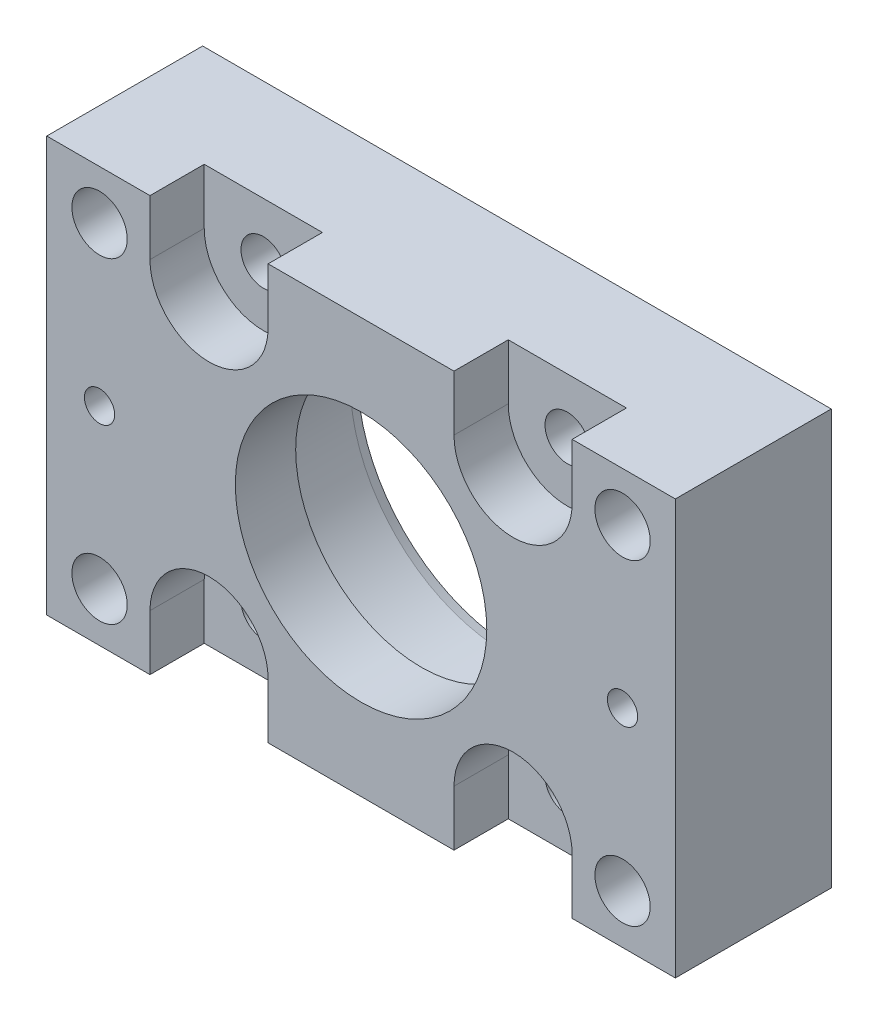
ISO-10303-21;
HEADER;
FILE_DESCRIPTION(('STEP AP214'),'2;1');
FILE_NAME('part.step','',(''),(''),'','','');
FILE_SCHEMA(('AUTOMOTIVE_DESIGN { 1 0 10303 214 1 1 1 1 }'));
ENDSEC;
DATA;
#1=APPLICATION_CONTEXT('core data for automotive mechanical design processes');
#2=APPLICATION_PROTOCOL_DEFINITION('international standard','automotive_design',2000,#1);
#3=PRODUCT_CONTEXT('',#1,'mechanical');
#4=PRODUCT('Part','Part','',(#3));
#5=PRODUCT_RELATED_PRODUCT_CATEGORY('part','',(#4));
#6=PRODUCT_DEFINITION_FORMATION('','',#4);
#7=PRODUCT_DEFINITION_CONTEXT('part definition',#1,'design');
#8=PRODUCT_DEFINITION('design','',#6,#7);
#9=PRODUCT_DEFINITION_SHAPE('','',#8);
#10=(LENGTH_UNIT() NAMED_UNIT(*) SI_UNIT(.MILLI.,.METRE.));
#11=(NAMED_UNIT(*) PLANE_ANGLE_UNIT() SI_UNIT($,.RADIAN.));
#12=(NAMED_UNIT(*) SI_UNIT($,.STERADIAN.) SOLID_ANGLE_UNIT());
#13=UNCERTAINTY_MEASURE_WITH_UNIT(LENGTH_MEASURE(1.E-05),#10,'distance_accuracy_value','');
#14=(GEOMETRIC_REPRESENTATION_CONTEXT(3) GLOBAL_UNCERTAINTY_ASSIGNED_CONTEXT((#13)) GLOBAL_UNIT_ASSIGNED_CONTEXT((#10,
#11,#12)) REPRESENTATION_CONTEXT('',''));
#15=CARTESIAN_POINT('',(0.,0.,0.));
#16=DIRECTION('',(0.,0.,1.));
#17=DIRECTION('',(1.,0.,0.));
#18=AXIS2_PLACEMENT_3D('',#15,#16,#17);
#19=CARTESIAN_POINT('',(60.4576297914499,-60.4576297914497,40.41));
#20=DIRECTION('',(0.,0.,1.));
#21=DIRECTION('',(1.,0.,0.));
#22=AXIS2_PLACEMENT_3D('',#19,#20,#21);
#23=CYLINDRICAL_SURFACE('',#22,23.495);
#24=CARTESIAN_POINT('',(60.4576297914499,-60.4576297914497,62.));
#25=DIRECTION('',(0.,0.,1.));
#26=DIRECTION('',(-1.,0.,0.));
#27=AXIS2_PLACEMENT_3D('',#24,#25,#26);
#28=CIRCLE('',#27,23.495);
#29=CARTESIAN_POINT('',(83.9526297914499,-60.4576297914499,62.));
#30=VERTEX_POINT('',#29);
#31=CARTESIAN_POINT('',(36.9626297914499,-60.4576297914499,62.));
#32=VERTEX_POINT('',#31);
#33=EDGE_CURVE('E305',#30,#32,#28,.T.);
#34=ORIENTED_EDGE('',*,*,#33,.T.);
#35=DIRECTION('',(0.,0.,1.));
#36=VECTOR('',#35,1.);
#37=CARTESIAN_POINT('',(36.9626297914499,-60.4576297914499,-11.4930460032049));
#38=LINE('',#37,#36);
#39=CARTESIAN_POINT('',(36.9626297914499,-60.4576297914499,40.41));
#40=VERTEX_POINT('',#39);
#41=EDGE_CURVE('E160',#40,#32,#38,.T.);
#42=ORIENTED_EDGE('',*,*,#41,.F.);
#43=CARTESIAN_POINT('',(60.4576297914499,-60.4576297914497,40.41));
#44=DIRECTION('',(0.,0.,1.));
#45=DIRECTION('',(-1.,0.,0.));
#46=AXIS2_PLACEMENT_3D('',#43,#44,#45);
#47=CIRCLE('',#46,23.495);
#48=CARTESIAN_POINT('',(83.9526297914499,-60.4576297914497,40.41));
#49=VERTEX_POINT('',#48);
#50=EDGE_CURVE('E228',#49,#40,#47,.T.);
#51=ORIENTED_EDGE('',*,*,#50,.F.);
#52=DIRECTION('',(0.,0.,1.));
#53=VECTOR('',#52,1.);
#54=CARTESIAN_POINT('',(83.9526297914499,-60.4576297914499,-11.4930460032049));
#55=LINE('',#54,#53);
#56=EDGE_CURVE('E576',#49,#30,#55,.T.);
#57=ORIENTED_EDGE('',*,*,#56,.T.);
#58=EDGE_LOOP('',(#34,#42,#51,#57));
#59=FACE_BOUND('',#58,.T.);
#60=ADVANCED_FACE('F14',(#59),#23,.F.);
#61=CARTESIAN_POINT('',(-60.4576297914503,-60.4576297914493,40.41));
#62=DIRECTION('',(0.,0.,1.));
#63=DIRECTION('',(1.,0.,0.));
#64=AXIS2_PLACEMENT_3D('',#61,#62,#63);
#65=CYLINDRICAL_SURFACE('',#64,23.495);
#66=CARTESIAN_POINT('',(-60.4576297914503,-60.4576297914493,62.));
#67=DIRECTION('',(0.,0.,1.));
#68=DIRECTION('',(0.,1.,0.));
#69=AXIS2_PLACEMENT_3D('',#66,#67,#68);
#70=CIRCLE('',#69,23.495);
#71=CARTESIAN_POINT('',(-36.9626297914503,-60.4576297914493,62.));
#72=VERTEX_POINT('',#71);
#73=CARTESIAN_POINT('',(-83.9526297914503,-60.4576297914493,62.));
#74=VERTEX_POINT('',#73);
#75=EDGE_CURVE('E297',#72,#74,#70,.T.);
#76=ORIENTED_EDGE('',*,*,#75,.T.);
#77=DIRECTION('',(0.,0.,1.));
#78=VECTOR('',#77,1.);
#79=CARTESIAN_POINT('',(-83.9526297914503,-60.4576297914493,-11.4930460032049));
#80=LINE('',#79,#78);
#81=CARTESIAN_POINT('',(-83.9526297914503,-60.4576297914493,40.41));
#82=VERTEX_POINT('',#81);
#83=EDGE_CURVE('E362',#82,#74,#80,.T.);
#84=ORIENTED_EDGE('',*,*,#83,.F.);
#85=CARTESIAN_POINT('',(-60.4576297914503,-60.4576297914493,40.41));
#86=DIRECTION('',(0.,0.,1.));
#87=DIRECTION('',(0.,1.,0.));
#88=AXIS2_PLACEMENT_3D('',#85,#86,#87);
#89=CIRCLE('',#88,23.495);
#90=CARTESIAN_POINT('',(-36.9626297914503,-60.4576297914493,40.41));
#91=VERTEX_POINT('',#90);
#92=EDGE_CURVE('E233',#91,#82,#89,.T.);
#93=ORIENTED_EDGE('',*,*,#92,.F.);
#94=DIRECTION('',(0.,0.,1.));
#95=VECTOR('',#94,1.);
#96=CARTESIAN_POINT('',(-36.9626297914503,-60.4576297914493,-11.4930460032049));
#97=LINE('',#96,#95);
#98=EDGE_CURVE('E363',#91,#72,#97,.T.);
#99=ORIENTED_EDGE('',*,*,#98,.T.);
#100=EDGE_LOOP('',(#76,#84,#93,#99));
#101=FACE_BOUND('',#100,.T.);
#102=ADVANCED_FACE('F360',(#101),#65,.F.);
#103=CARTESIAN_POINT('',(-60.4576297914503,-60.4576297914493,0.));
#104=DIRECTION('',(0.,0.,1.));
#105=DIRECTION('',(1.,0.,0.));
#106=AXIS2_PLACEMENT_3D('',#103,#104,#105);
#107=CYLINDRICAL_SURFACE('',#106,8.89);
#108=CARTESIAN_POINT('',(-60.4576297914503,-60.4576297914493,40.41));
#109=DIRECTION('',(0.,0.,1.));
#110=DIRECTION('',(1.,0.,0.));
#111=AXIS2_PLACEMENT_3D('',#108,#109,#110);
#112=CIRCLE('',#111,8.89);
#113=CARTESIAN_POINT('',(-51.5676297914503,-60.4576297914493,40.41));
#114=VERTEX_POINT('',#113);
#115=EDGE_CURVE('E229',#114,#114,#112,.F.);
#116=ORIENTED_EDGE('',*,*,#115,.F.);
#117=EDGE_LOOP('',(#116));
#118=FACE_BOUND('',#117,.T.);
#119=CARTESIAN_POINT('',(-60.4576297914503,-60.4576297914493,19.812));
#120=DIRECTION('',(0.,0.,-1.));
#121=DIRECTION('',(-1.,0.,0.));
#122=AXIS2_PLACEMENT_3D('',#119,#120,#121);
#123=CIRCLE('',#122,8.89);
#124=CARTESIAN_POINT('',(-69.3476297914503,-60.4576297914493,19.812));
#125=VERTEX_POINT('',#124);
#126=EDGE_CURVE('E18',#125,#125,#123,.F.);
#127=ORIENTED_EDGE('',*,*,#126,.F.);
#128=EDGE_LOOP('',(#127));
#129=FACE_BOUND('',#128,.T.);
#130=ADVANCED_FACE('F472',(#118,#129),#107,.F.);
#131=CARTESIAN_POINT('',(60.4576297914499,-60.4576297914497,0.));
#132=DIRECTION('',(0.,0.,1.));
#133=DIRECTION('',(1.,0.,0.));
#134=AXIS2_PLACEMENT_3D('',#131,#132,#133);
#135=CYLINDRICAL_SURFACE('',#134,8.89);
#136=CARTESIAN_POINT('',(60.4576297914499,-60.4576297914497,40.41));
#137=DIRECTION('',(0.,0.,1.));
#138=DIRECTION('',(1.,0.,0.));
#139=AXIS2_PLACEMENT_3D('',#136,#137,#138);
#140=CIRCLE('',#139,8.89);
#141=CARTESIAN_POINT('',(69.3476297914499,-60.4576297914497,40.41));
#142=VERTEX_POINT('',#141);
#143=EDGE_CURVE('E225',#142,#142,#140,.F.);
#144=ORIENTED_EDGE('',*,*,#143,.F.);
#145=EDGE_LOOP('',(#144));
#146=FACE_BOUND('',#145,.T.);
#147=CARTESIAN_POINT('',(60.4576297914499,-60.4576297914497,19.812));
#148=DIRECTION('',(0.,0.,-1.));
#149=DIRECTION('',(-1.,0.,0.));
#150=AXIS2_PLACEMENT_3D('',#147,#148,#149);
#151=CIRCLE('',#150,8.89);
#152=CARTESIAN_POINT('',(51.5676297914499,-60.4576297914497,19.812));
#153=VERTEX_POINT('',#152);
#154=EDGE_CURVE('E245',#153,#153,#151,.F.);
#155=ORIENTED_EDGE('',*,*,#154,.F.);
#156=EDGE_LOOP('',(#155));
#157=FACE_BOUND('',#156,.T.);
#158=ADVANCED_FACE('F488',(#146,#157),#135,.F.);
#159=CARTESIAN_POINT('',(-60.4576297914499,60.4576297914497,0.));
#160=DIRECTION('',(0.,0.,1.));
#161=DIRECTION('',(1.,0.,0.));
#162=AXIS2_PLACEMENT_3D('',#159,#160,#161);
#163=CYLINDRICAL_SURFACE('',#162,8.89);
#164=CARTESIAN_POINT('',(-60.4576297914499,60.4576297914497,40.41));
#165=DIRECTION('',(0.,0.,1.));
#166=DIRECTION('',(1.,0.,0.));
#167=AXIS2_PLACEMENT_3D('',#164,#165,#166);
#168=CIRCLE('',#167,8.89);
#169=CARTESIAN_POINT('',(-51.5676297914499,60.4576297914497,40.41));
#170=VERTEX_POINT('',#169);
#171=EDGE_CURVE('E215',#170,#170,#168,.F.);
#172=ORIENTED_EDGE('',*,*,#171,.F.);
#173=EDGE_LOOP('',(#172));
#174=FACE_BOUND('',#173,.T.);
#175=CARTESIAN_POINT('',(-60.4576297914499,60.4576297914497,19.812));
#176=DIRECTION('',(0.,0.,-1.));
#177=DIRECTION('',(-1.,0.,0.));
#178=AXIS2_PLACEMENT_3D('',#175,#176,#177);
#179=CIRCLE('',#178,8.89);
#180=CARTESIAN_POINT('',(-69.3476297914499,60.4576297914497,19.812));
#181=VERTEX_POINT('',#180);
#182=EDGE_CURVE('E241',#181,#181,#179,.F.);
#183=ORIENTED_EDGE('',*,*,#182,.F.);
#184=EDGE_LOOP('',(#183));
#185=FACE_BOUND('',#184,.T.);
#186=ADVANCED_FACE('F492',(#174,#185),#163,.F.);
#187=CARTESIAN_POINT('',(60.4576297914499,60.4576297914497,0.));
#188=DIRECTION('',(0.,0.,1.));
#189=DIRECTION('',(1.,0.,0.));
#190=AXIS2_PLACEMENT_3D('',#187,#188,#189);
#191=CYLINDRICAL_SURFACE('',#190,8.89);
#192=CARTESIAN_POINT('',(60.4576297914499,60.4576297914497,40.41));
#193=DIRECTION('',(0.,0.,1.));
#194=DIRECTION('',(1.,0.,0.));
#195=AXIS2_PLACEMENT_3D('',#192,#193,#194);
#196=CIRCLE('',#195,8.89);
#197=CARTESIAN_POINT('',(69.3476297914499,60.4576297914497,40.41));
#198=VERTEX_POINT('',#197);
#199=EDGE_CURVE('E220',#198,#198,#196,.F.);
#200=ORIENTED_EDGE('',*,*,#199,.F.);
#201=EDGE_LOOP('',(#200));
#202=FACE_BOUND('',#201,.T.);
#203=CARTESIAN_POINT('',(60.4576297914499,60.4576297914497,19.812));
#204=DIRECTION('',(0.,0.,-1.));
#205=DIRECTION('',(-1.,0.,0.));
#206=AXIS2_PLACEMENT_3D('',#203,#204,#205);
#207=CIRCLE('',#206,8.89);
#208=CARTESIAN_POINT('',(51.5676297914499,60.4576297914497,19.812));
#209=VERTEX_POINT('',#208);
#210=EDGE_CURVE('E236',#209,#209,#207,.F.);
#211=ORIENTED_EDGE('',*,*,#210,.F.);
#212=EDGE_LOOP('',(#211));
#213=FACE_BOUND('',#212,.T.);
#214=ADVANCED_FACE('F494',(#202,#213),#191,.F.);
#215=CARTESIAN_POINT('',(-125.,82.5,62.));
#216=DIRECTION('',(0.,-1.,0.));
#217=DIRECTION('',(1.,0.,0.));
#218=AXIS2_PLACEMENT_3D('',#215,#216,#217);
#219=PLANE('',#218);
#220=DIRECTION('',(-1.,0.,0.));
#221=VECTOR('',#220,1.);
#222=CARTESIAN_POINT('',(-125.,82.5,40.41));
#223=LINE('',#222,#221);
#224=CARTESIAN_POINT('',(83.9526297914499,82.5,40.41));
#225=VERTEX_POINT('',#224);
#226=CARTESIAN_POINT('',(36.9626297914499,82.5,40.41));
#227=VERTEX_POINT('',#226);
#228=EDGE_CURVE('E223',#225,#227,#223,.T.);
#229=ORIENTED_EDGE('',*,*,#228,.F.);
#230=DIRECTION('',(0.,0.,1.));
#231=VECTOR('',#230,1.);
#232=CARTESIAN_POINT('',(83.9526297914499,82.5,-11.4930460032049));
#233=LINE('',#232,#231);
#234=CARTESIAN_POINT('',(83.9526297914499,82.5,62.));
#235=VERTEX_POINT('',#234);
#236=EDGE_CURVE('E565',#225,#235,#233,.T.);
#237=ORIENTED_EDGE('',*,*,#236,.T.);
#238=DIRECTION('',(-1.,0.,0.));
#239=VECTOR('',#238,1.);
#240=CARTESIAN_POINT('',(-125.,82.5,62.));
#241=LINE('',#240,#239);
#242=CARTESIAN_POINT('',(125.,82.5,62.));
#243=VERTEX_POINT('',#242);
#244=EDGE_CURVE('E323',#243,#235,#241,.T.);
#245=ORIENTED_EDGE('',*,*,#244,.F.);
#246=DIRECTION('',(0.,0.,-1.));
#247=VECTOR('',#246,1.);
#248=CARTESIAN_POINT('',(125.,82.5,62.));
#249=LINE('',#248,#247);
#250=CARTESIAN_POINT('',(125.,82.5,0.));
#251=VERTEX_POINT('',#250);
#252=EDGE_CURVE('E192',#243,#251,#249,.T.);
#253=ORIENTED_EDGE('',*,*,#252,.T.);
#254=DIRECTION('',(-1.,0.,0.));
#255=VECTOR('',#254,1.);
#256=CARTESIAN_POINT('',(-125.,82.5,0.));
#257=LINE('',#256,#255);
#258=CARTESIAN_POINT('',(-125.,82.5,0.));
#259=VERTEX_POINT('',#258);
#260=EDGE_CURVE('E193',#251,#259,#257,.T.);
#261=ORIENTED_EDGE('',*,*,#260,.T.);
#262=DIRECTION('',(0.,0.,-1.));
#263=VECTOR('',#262,1.);
#264=CARTESIAN_POINT('',(-125.,82.5,62.));
#265=LINE('',#264,#263);
#266=CARTESIAN_POINT('',(-125.,82.5,62.));
#267=VERTEX_POINT('',#266);
#268=EDGE_CURVE('E212',#267,#259,#265,.T.);
#269=ORIENTED_EDGE('',*,*,#268,.F.);
#270=CARTESIAN_POINT('',(-83.9526297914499,82.5,62.));
#271=VERTEX_POINT('',#270);
#272=EDGE_CURVE('E203',#271,#267,#241,.T.);
#273=ORIENTED_EDGE('',*,*,#272,.F.);
#274=DIRECTION('',(0.,0.,1.));
#275=VECTOR('',#274,1.);
#276=CARTESIAN_POINT('',(-83.9526297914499,82.5,-11.4930460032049));
#277=LINE('',#276,#275);
#278=CARTESIAN_POINT('',(-83.9526297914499,82.5,40.41));
#279=VERTEX_POINT('',#278);
#280=EDGE_CURVE('E378',#279,#271,#277,.T.);
#281=ORIENTED_EDGE('',*,*,#280,.F.);
#282=DIRECTION('',(-1.,0.,0.));
#283=VECTOR('',#282,1.);
#284=CARTESIAN_POINT('',(-125.,82.5,40.41));
#285=LINE('',#284,#283);
#286=CARTESIAN_POINT('',(-36.9626297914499,82.5,40.41));
#287=VERTEX_POINT('',#286);
#288=EDGE_CURVE('E218',#287,#279,#285,.T.);
#289=ORIENTED_EDGE('',*,*,#288,.F.);
#290=DIRECTION('',(0.,0.,1.));
#291=VECTOR('',#290,1.);
#292=CARTESIAN_POINT('',(-36.9626297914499,82.5,-11.4930460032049));
#293=LINE('',#292,#291);
#294=CARTESIAN_POINT('',(-36.9626297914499,82.5,62.));
#295=VERTEX_POINT('',#294);
#296=EDGE_CURVE('E386',#287,#295,#293,.T.);
#297=ORIENTED_EDGE('',*,*,#296,.T.);
#298=CARTESIAN_POINT('',(36.9626297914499,82.5,62.));
#299=VERTEX_POINT('',#298);
#300=EDGE_CURVE('E325',#299,#295,#241,.T.);
#301=ORIENTED_EDGE('',*,*,#300,.F.);
#302=DIRECTION('',(0.,0.,1.));
#303=VECTOR('',#302,1.);
#304=CARTESIAN_POINT('',(36.9626297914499,82.5,-11.4930460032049));
#305=LINE('',#304,#303);
#306=EDGE_CURVE('E568',#227,#299,#305,.T.);
#307=ORIENTED_EDGE('',*,*,#306,.F.);
#308=EDGE_LOOP('',(#229,#237,#245,#253,#261,#269,#273,#281,#289,#297,#301,#307));
#309=FACE_BOUND('',#308,.T.);
#310=ADVANCED_FACE('F341',(#309),#219,.F.);
#311=CARTESIAN_POINT('',(-125.,82.5,62.));
#312=DIRECTION('',(1.,0.,0.));
#313=DIRECTION('',(0.,1.,0.));
#314=AXIS2_PLACEMENT_3D('',#311,#312,#313);
#315=PLANE('',#314);
#316=DIRECTION('',(0.,-1.,0.));
#317=VECTOR('',#316,1.);
#318=CARTESIAN_POINT('',(-125.,82.5,0.));
#319=LINE('',#318,#317);
#320=CARTESIAN_POINT('',(-125.,-82.5,0.));
#321=VERTEX_POINT('',#320);
#322=EDGE_CURVE('E196',#259,#321,#319,.T.);
#323=ORIENTED_EDGE('',*,*,#322,.T.);
#324=DIRECTION('',(0.,0.,-1.));
#325=VECTOR('',#324,1.);
#326=CARTESIAN_POINT('',(-125.,-82.5,62.));
#327=LINE('',#326,#325);
#328=CARTESIAN_POINT('',(-125.,-82.5,62.));
#329=VERTEX_POINT('',#328);
#330=EDGE_CURVE('E209',#329,#321,#327,.T.);
#331=ORIENTED_EDGE('',*,*,#330,.F.);
#332=DIRECTION('',(0.,-1.,0.));
#333=VECTOR('',#332,1.);
#334=CARTESIAN_POINT('',(-125.,82.5,62.));
#335=LINE('',#334,#333);
#336=EDGE_CURVE('E187',#267,#329,#335,.T.);
#337=ORIENTED_EDGE('',*,*,#336,.F.);
#338=ORIENTED_EDGE('',*,*,#268,.T.);
#339=EDGE_LOOP('',(#323,#331,#337,#338));
#340=FACE_BOUND('',#339,.T.);
#341=ADVANCED_FACE('F339',(#340),#315,.F.);
#342=CARTESIAN_POINT('',(-125.,-82.5,62.));
#343=DIRECTION('',(0.,1.,0.));
#344=DIRECTION('',(-1.,0.,0.));
#345=AXIS2_PLACEMENT_3D('',#342,#343,#344);
#346=PLANE('',#345);
#347=DIRECTION('',(1.,0.,0.));
#348=VECTOR('',#347,1.);
#349=CARTESIAN_POINT('',(-125.,-82.5,40.41));
#350=LINE('',#349,#348);
#351=CARTESIAN_POINT('',(-83.9526297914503,-82.5,40.41));
#352=VERTEX_POINT('',#351);
#353=CARTESIAN_POINT('',(-36.9626297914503,-82.5,40.41));
#354=VERTEX_POINT('',#353);
#355=EDGE_CURVE('E232',#352,#354,#350,.T.);
#356=ORIENTED_EDGE('',*,*,#355,.F.);
#357=DIRECTION('',(0.,0.,1.));
#358=VECTOR('',#357,1.);
#359=CARTESIAN_POINT('',(-83.9526297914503,-82.5,-11.4930460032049));
#360=LINE('',#359,#358);
#361=CARTESIAN_POINT('',(-83.9526297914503,-82.5,62.));
#362=VERTEX_POINT('',#361);
#363=EDGE_CURVE('E351',#352,#362,#360,.T.);
#364=ORIENTED_EDGE('',*,*,#363,.T.);
#365=DIRECTION('',(1.,0.,0.));
#366=VECTOR('',#365,1.);
#367=CARTESIAN_POINT('',(-125.,-82.5,62.));
#368=LINE('',#367,#366);
#369=EDGE_CURVE('E182',#329,#362,#368,.T.);
#370=ORIENTED_EDGE('',*,*,#369,.F.);
#371=ORIENTED_EDGE('',*,*,#330,.T.);
#372=DIRECTION('',(1.,0.,0.));
#373=VECTOR('',#372,1.);
#374=CARTESIAN_POINT('',(-125.,-82.5,0.));
#375=LINE('',#374,#373);
#376=CARTESIAN_POINT('',(125.,-82.5,0.));
#377=VERTEX_POINT('',#376);
#378=EDGE_CURVE('E199',#321,#377,#375,.T.);
#379=ORIENTED_EDGE('',*,*,#378,.T.);
#380=DIRECTION('',(0.,0.,-1.));
#381=VECTOR('',#380,1.);
#382=CARTESIAN_POINT('',(125.,-82.5,62.));
#383=LINE('',#382,#381);
#384=CARTESIAN_POINT('',(125.,-82.5,62.));
#385=VERTEX_POINT('',#384);
#386=EDGE_CURVE('E206',#385,#377,#383,.T.);
#387=ORIENTED_EDGE('',*,*,#386,.F.);
#388=CARTESIAN_POINT('',(83.9526297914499,-82.5,62.));
#389=VERTEX_POINT('',#388);
#390=EDGE_CURVE('E183',#389,#385,#368,.T.);
#391=ORIENTED_EDGE('',*,*,#390,.F.);
#392=DIRECTION('',(0.,0.,1.));
#393=VECTOR('',#392,1.);
#394=CARTESIAN_POINT('',(83.9526297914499,-82.5,-11.4930460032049));
#395=LINE('',#394,#393);
#396=CARTESIAN_POINT('',(83.9526297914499,-82.5,40.41));
#397=VERTEX_POINT('',#396);
#398=EDGE_CURVE('E175',#397,#389,#395,.T.);
#399=ORIENTED_EDGE('',*,*,#398,.F.);
#400=DIRECTION('',(1.,0.,0.));
#401=VECTOR('',#400,1.);
#402=CARTESIAN_POINT('',(-125.,-82.5,40.41));
#403=LINE('',#402,#401);
#404=CARTESIAN_POINT('',(36.9626297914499,-82.5,40.41));
#405=VERTEX_POINT('',#404);
#406=EDGE_CURVE('E173',#405,#397,#403,.T.);
#407=ORIENTED_EDGE('',*,*,#406,.F.);
#408=DIRECTION('',(0.,0.,1.));
#409=VECTOR('',#408,1.);
#410=CARTESIAN_POINT('',(36.9626297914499,-82.5,-11.4930460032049));
#411=LINE('',#410,#409);
#412=CARTESIAN_POINT('',(36.9626297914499,-82.5,62.));
#413=VERTEX_POINT('',#412);
#414=EDGE_CURVE('E158',#405,#413,#411,.T.);
#415=ORIENTED_EDGE('',*,*,#414,.T.);
#416=CARTESIAN_POINT('',(-36.9626297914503,-82.5,62.));
#417=VERTEX_POINT('',#416);
#418=EDGE_CURVE('E171',#417,#413,#368,.T.);
#419=ORIENTED_EDGE('',*,*,#418,.F.);
#420=DIRECTION('',(0.,0.,1.));
#421=VECTOR('',#420,1.);
#422=CARTESIAN_POINT('',(-36.9626297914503,-82.5,-11.4930460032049));
#423=LINE('',#422,#421);
#424=EDGE_CURVE('E367',#354,#417,#423,.T.);
#425=ORIENTED_EDGE('',*,*,#424,.F.);
#426=EDGE_LOOP('',(#356,#364,#370,#371,#379,#387,#391,#399,#407,#415,#419,#425));
#427=FACE_BOUND('',#426,.T.);
#428=ADVANCED_FACE('F169',(#427),#346,.F.);
#429=CARTESIAN_POINT('',(125.,82.5,62.));
#430=DIRECTION('',(-1.,0.,0.));
#431=DIRECTION('',(0.,-1.,0.));
#432=AXIS2_PLACEMENT_3D('',#429,#430,#431);
#433=PLANE('',#432);
#434=DIRECTION('',(0.,1.,0.));
#435=VECTOR('',#434,1.);
#436=CARTESIAN_POINT('',(125.,82.5,0.));
#437=LINE('',#436,#435);
#438=EDGE_CURVE('E201',#377,#251,#437,.T.);
#439=ORIENTED_EDGE('',*,*,#438,.T.);
#440=ORIENTED_EDGE('',*,*,#252,.F.);
#441=DIRECTION('',(0.,1.,0.));
#442=VECTOR('',#441,1.);
#443=CARTESIAN_POINT('',(125.,82.5,62.));
#444=LINE('',#443,#442);
#445=EDGE_CURVE('E186',#385,#243,#444,.T.);
#446=ORIENTED_EDGE('',*,*,#445,.F.);
#447=ORIENTED_EDGE('',*,*,#386,.T.);
#448=EDGE_LOOP('',(#439,#440,#446,#447));
#449=FACE_BOUND('',#448,.T.);
#450=ADVANCED_FACE('F442',(#449),#433,.F.);
#451=CARTESIAN_POINT('',(0.,0.,62.));
#452=DIRECTION('',(0.,0.,-1.));
#453=DIRECTION('',(-1.,0.,0.));
#454=AXIS2_PLACEMENT_3D('',#451,#452,#453);
#455=PLANE('',#454);
#456=CARTESIAN_POINT('',(104.,0.,62.));
#457=DIRECTION('',(0.,0.,1.));
#458=DIRECTION('',(1.,0.,0.));
#459=AXIS2_PLACEMENT_3D('',#456,#457,#458);
#460=CIRCLE('',#459,6.00634993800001);
#461=CARTESIAN_POINT('',(110.006349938,0.,62.));
#462=VERTEX_POINT('',#461);
#463=EDGE_CURVE('E380',#462,#462,#460,.T.);
#464=ORIENTED_EDGE('',*,*,#463,.F.);
#465=EDGE_LOOP('',(#464));
#466=FACE_BOUND('',#465,.T.);
#467=CARTESIAN_POINT('',(-104.,0.,62.));
#468=DIRECTION('',(0.,0.,1.));
#469=DIRECTION('',(1.,0.,0.));
#470=AXIS2_PLACEMENT_3D('',#467,#468,#469);
#471=CIRCLE('',#470,6.00634993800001);
#472=CARTESIAN_POINT('',(-97.993650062,0.,62.));
#473=VERTEX_POINT('',#472);
#474=EDGE_CURVE('E395',#473,#473,#471,.T.);
#475=ORIENTED_EDGE('',*,*,#474,.F.);
#476=EDGE_LOOP('',(#475));
#477=FACE_BOUND('',#476,.T.);
#478=CARTESIAN_POINT('',(104.,-63.,62.));
#479=DIRECTION('',(0.,0.,1.));
#480=DIRECTION('',(1.,0.,0.));
#481=AXIS2_PLACEMENT_3D('',#478,#479,#480);
#482=CIRCLE('',#481,11.);
#483=CARTESIAN_POINT('',(115.,-63.,62.));
#484=VERTEX_POINT('',#483);
#485=EDGE_CURVE('E239',#484,#484,#482,.T.);
#486=ORIENTED_EDGE('',*,*,#485,.F.);
#487=EDGE_LOOP('',(#486));
#488=FACE_BOUND('',#487,.T.);
#489=CARTESIAN_POINT('',(-104.,-63.,62.));
#490=DIRECTION('',(0.,0.,1.));
#491=DIRECTION('',(-1.,0.,0.));
#492=AXIS2_PLACEMENT_3D('',#489,#490,#491);
#493=CIRCLE('',#492,11.);
#494=CARTESIAN_POINT('',(-115.,-63.,62.));
#495=VERTEX_POINT('',#494);
#496=EDGE_CURVE('E273',#495,#495,#493,.T.);
#497=ORIENTED_EDGE('',*,*,#496,.F.);
#498=EDGE_LOOP('',(#497));
#499=FACE_BOUND('',#498,.T.);
#500=CARTESIAN_POINT('',(104.,63.,62.));
#501=DIRECTION('',(0.,0.,1.));
#502=DIRECTION('',(-1.,0.,0.));
#503=AXIS2_PLACEMENT_3D('',#500,#501,#502);
#504=CIRCLE('',#503,11.);
#505=CARTESIAN_POINT('',(93.,63.,62.));
#506=VERTEX_POINT('',#505);
#507=EDGE_CURVE('E279',#506,#506,#504,.T.);
#508=ORIENTED_EDGE('',*,*,#507,.F.);
#509=EDGE_LOOP('',(#508));
#510=FACE_BOUND('',#509,.T.);
#511=CARTESIAN_POINT('',(-104.,63.,62.));
#512=DIRECTION('',(0.,0.,1.));
#513=DIRECTION('',(1.,0.,0.));
#514=AXIS2_PLACEMENT_3D('',#511,#512,#513);
#515=CIRCLE('',#514,11.);
#516=CARTESIAN_POINT('',(-93.,63.,62.));
#517=VERTEX_POINT('',#516);
#518=EDGE_CURVE('E285',#517,#517,#515,.T.);
#519=ORIENTED_EDGE('',*,*,#518,.F.);
#520=EDGE_LOOP('',(#519));
#521=FACE_BOUND('',#520,.T.);
#522=CARTESIAN_POINT('',(0.,0.,62.));
#523=DIRECTION('',(0.,0.,-1.));
#524=DIRECTION('',(-1.,0.,0.));
#525=AXIS2_PLACEMENT_3D('',#522,#523,#524);
#526=CIRCLE('',#525,50.);
#527=CARTESIAN_POINT('',(-50.,0.,62.));
#528=VERTEX_POINT('',#527);
#529=EDGE_CURVE('E294',#528,#528,#526,.T.);
#530=ORIENTED_EDGE('',*,*,#529,.T.);
#531=EDGE_LOOP('',(#530));
#532=FACE_BOUND('',#531,.T.);
#533=CARTESIAN_POINT('',(60.4576297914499,60.4576297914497,62.));
#534=DIRECTION('',(0.,0.,1.));
#535=DIRECTION('',(0.,-1.,0.));
#536=AXIS2_PLACEMENT_3D('',#533,#534,#535);
#537=CIRCLE('',#536,23.495);
#538=CARTESIAN_POINT('',(36.9626297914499,60.4576297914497,62.));
#539=VERTEX_POINT('',#538);
#540=CARTESIAN_POINT('',(83.9526297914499,60.4576297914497,62.));
#541=VERTEX_POINT('',#540);
#542=EDGE_CURVE('E310',#539,#541,#537,.T.);
#543=ORIENTED_EDGE('',*,*,#542,.F.);
#544=DIRECTION('',(0.,-1.,0.));
#545=VECTOR('',#544,1.);
#546=CARTESIAN_POINT('',(36.9626297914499,60.4576297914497,62.));
#547=LINE('',#546,#545);
#548=EDGE_CURVE('E558',#299,#539,#547,.T.);
#549=ORIENTED_EDGE('',*,*,#548,.F.);
#550=ORIENTED_EDGE('',*,*,#300,.T.);
#551=DIRECTION('',(0.,1.,0.));
#552=VECTOR('',#551,1.);
#553=CARTESIAN_POINT('',(-36.9626297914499,60.4576297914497,62.));
#554=LINE('',#553,#552);
#555=CARTESIAN_POINT('',(-36.9626297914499,60.4576297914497,62.));
#556=VERTEX_POINT('',#555);
#557=EDGE_CURVE('E382',#556,#295,#554,.T.);
#558=ORIENTED_EDGE('',*,*,#557,.F.);
#559=CARTESIAN_POINT('',(-60.4576297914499,60.4576297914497,62.));
#560=DIRECTION('',(0.,0.,1.));
#561=DIRECTION('',(1.,0.,0.));
#562=AXIS2_PLACEMENT_3D('',#559,#560,#561);
#563=CIRCLE('',#562,23.495);
#564=CARTESIAN_POINT('',(-83.9526297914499,60.4576297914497,62.));
#565=VERTEX_POINT('',#564);
#566=EDGE_CURVE('E316',#565,#556,#563,.T.);
#567=ORIENTED_EDGE('',*,*,#566,.F.);
#568=DIRECTION('',(0.,-1.,0.));
#569=VECTOR('',#568,1.);
#570=CARTESIAN_POINT('',(-83.9526297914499,60.4576297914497,62.));
#571=LINE('',#570,#569);
#572=EDGE_CURVE('E334',#271,#565,#571,.T.);
#573=ORIENTED_EDGE('',*,*,#572,.F.);
#574=ORIENTED_EDGE('',*,*,#272,.T.);
#575=ORIENTED_EDGE('',*,*,#336,.T.);
#576=ORIENTED_EDGE('',*,*,#369,.T.);
#577=DIRECTION('',(0.,-1.,0.));
#578=VECTOR('',#577,1.);
#579=CARTESIAN_POINT('',(-83.9526297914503,-60.4576297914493,62.));
#580=LINE('',#579,#578);
#581=EDGE_CURVE('E353',#74,#362,#580,.T.);
#582=ORIENTED_EDGE('',*,*,#581,.F.);
#583=ORIENTED_EDGE('',*,*,#75,.F.);
#584=DIRECTION('',(0.,1.,0.));
#585=VECTOR('',#584,1.);
#586=CARTESIAN_POINT('',(-36.9626297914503,-60.4576297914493,62.));
#587=LINE('',#586,#585);
#588=EDGE_CURVE('E181',#417,#72,#587,.T.);
#589=ORIENTED_EDGE('',*,*,#588,.F.);
#590=ORIENTED_EDGE('',*,*,#418,.T.);
#591=DIRECTION('',(0.,-1.,0.));
#592=VECTOR('',#591,1.);
#593=CARTESIAN_POINT('',(36.9626297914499,-60.4576297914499,62.));
#594=LINE('',#593,#592);
#595=EDGE_CURVE('E155',#32,#413,#594,.T.);
#596=ORIENTED_EDGE('',*,*,#595,.F.);
#597=ORIENTED_EDGE('',*,*,#33,.F.);
#598=DIRECTION('',(0.,1.,0.));
#599=VECTOR('',#598,1.);
#600=CARTESIAN_POINT('',(83.9526297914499,-60.4576297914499,62.));
#601=LINE('',#600,#599);
#602=EDGE_CURVE('E165',#389,#30,#601,.T.);
#603=ORIENTED_EDGE('',*,*,#602,.F.);
#604=ORIENTED_EDGE('',*,*,#390,.T.);
#605=ORIENTED_EDGE('',*,*,#445,.T.);
#606=ORIENTED_EDGE('',*,*,#244,.T.);
#607=DIRECTION('',(0.,1.,0.));
#608=VECTOR('',#607,1.);
#609=CARTESIAN_POINT('',(83.9526297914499,60.4576297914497,62.));
#610=LINE('',#609,#608);
#611=EDGE_CURVE('E563',#541,#235,#610,.T.);
#612=ORIENTED_EDGE('',*,*,#611,.F.);
#613=EDGE_LOOP('',(#543,#549,#550,#558,#567,#573,#574,#575,#576,#582,#583,#589,#590,#596,#597,
#603,#604,#605,#606,#612));
#614=FACE_BOUND('',#613,.T.);
#615=ADVANCED_FACE('F179',(#466,#477,#488,#499,#510,#521,#532,#614),#455,.F.);
#616=CARTESIAN_POINT('',(0.,0.,0.));
#617=DIRECTION('',(0.,0.,-1.));
#618=DIRECTION('',(-1.,0.,0.));
#619=AXIS2_PLACEMENT_3D('',#616,#617,#618);
#620=PLANE('',#619);
#621=CARTESIAN_POINT('',(-60.4576297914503,-60.4576297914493,0.));
#622=DIRECTION('',(0.,0.,-1.));
#623=DIRECTION('',(-1.,0.,0.));
#624=AXIS2_PLACEMENT_3D('',#621,#622,#623);
#625=CIRCLE('',#624,19.05);
#626=CARTESIAN_POINT('',(-79.5076297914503,-60.4576297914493,0.));
#627=VERTEX_POINT('',#626);
#628=EDGE_CURVE('E261',#627,#627,#625,.T.);
#629=ORIENTED_EDGE('',*,*,#628,.F.);
#630=EDGE_LOOP('',(#629));
#631=FACE_BOUND('',#630,.T.);
#632=CARTESIAN_POINT('',(60.4576297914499,-60.4576297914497,0.));
#633=DIRECTION('',(0.,0.,-1.));
#634=DIRECTION('',(-1.,0.,0.));
#635=AXIS2_PLACEMENT_3D('',#632,#633,#634);
#636=CIRCLE('',#635,19.05);
#637=CARTESIAN_POINT('',(41.4076297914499,-60.4576297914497,0.));
#638=VERTEX_POINT('',#637);
#639=EDGE_CURVE('E254',#638,#638,#636,.T.);
#640=ORIENTED_EDGE('',*,*,#639,.F.);
#641=EDGE_LOOP('',(#640));
#642=FACE_BOUND('',#641,.T.);
#643=CARTESIAN_POINT('',(-60.4576297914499,60.4576297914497,0.));
#644=DIRECTION('',(0.,0.,-1.));
#645=DIRECTION('',(-1.,0.,0.));
#646=AXIS2_PLACEMENT_3D('',#643,#644,#645);
#647=CIRCLE('',#646,19.05);
#648=CARTESIAN_POINT('',(-79.5076297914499,60.4576297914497,0.));
#649=VERTEX_POINT('',#648);
#650=EDGE_CURVE('E247',#649,#649,#647,.T.);
#651=ORIENTED_EDGE('',*,*,#650,.F.);
#652=EDGE_LOOP('',(#651));
#653=FACE_BOUND('',#652,.T.);
#654=CARTESIAN_POINT('',(60.4576297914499,60.4576297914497,0.));
#655=DIRECTION('',(0.,0.,-1.));
#656=DIRECTION('',(-1.,0.,0.));
#657=AXIS2_PLACEMENT_3D('',#654,#655,#656);
#658=CIRCLE('',#657,19.05);
#659=CARTESIAN_POINT('',(41.4076297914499,60.4576297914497,0.));
#660=VERTEX_POINT('',#659);
#661=EDGE_CURVE('E243',#660,#660,#658,.T.);
#662=ORIENTED_EDGE('',*,*,#661,.F.);
#663=EDGE_LOOP('',(#662));
#664=FACE_BOUND('',#663,.T.);
#665=CARTESIAN_POINT('',(0.,0.,0.));
#666=DIRECTION('',(0.,0.,-1.));
#667=DIRECTION('',(-1.,0.,0.));
#668=AXIS2_PLACEMENT_3D('',#665,#666,#667);
#669=CIRCLE('',#668,63.3923077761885);
#670=CARTESIAN_POINT('',(-63.3923077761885,0.,0.));
#671=VERTEX_POINT('',#670);
#672=EDGE_CURVE('E23',#671,#671,#669,.F.);
#673=ORIENTED_EDGE('',*,*,#672,.T.);
#674=EDGE_LOOP('',(#673));
#675=FACE_BOUND('',#674,.T.);
#676=CARTESIAN_POINT('',(104.,-63.,0.));
#677=DIRECTION('',(0.,0.,1.));
#678=DIRECTION('',(1.,0.,0.));
#679=AXIS2_PLACEMENT_3D('',#676,#677,#678);
#680=CIRCLE('',#679,11.);
#681=CARTESIAN_POINT('',(115.,-63.,0.));
#682=VERTEX_POINT('',#681);
#683=EDGE_CURVE('E270',#682,#682,#680,.T.);
#684=ORIENTED_EDGE('',*,*,#683,.T.);
#685=EDGE_LOOP('',(#684));
#686=FACE_BOUND('',#685,.T.);
#687=CARTESIAN_POINT('',(-104.,-63.,0.));
#688=DIRECTION('',(0.,0.,1.));
#689=DIRECTION('',(-1.,0.,0.));
#690=AXIS2_PLACEMENT_3D('',#687,#688,#689);
#691=CIRCLE('',#690,11.);
#692=CARTESIAN_POINT('',(-115.,-63.,0.));
#693=VERTEX_POINT('',#692);
#694=EDGE_CURVE('E276',#693,#693,#691,.T.);
#695=ORIENTED_EDGE('',*,*,#694,.T.);
#696=EDGE_LOOP('',(#695));
#697=FACE_BOUND('',#696,.T.);
#698=CARTESIAN_POINT('',(104.,63.,0.));
#699=DIRECTION('',(0.,0.,1.));
#700=DIRECTION('',(-1.,0.,0.));
#701=AXIS2_PLACEMENT_3D('',#698,#699,#700);
#702=CIRCLE('',#701,11.);
#703=CARTESIAN_POINT('',(93.,63.,0.));
#704=VERTEX_POINT('',#703);
#705=EDGE_CURVE('E282',#704,#704,#702,.T.);
#706=ORIENTED_EDGE('',*,*,#705,.T.);
#707=EDGE_LOOP('',(#706));
#708=FACE_BOUND('',#707,.T.);
#709=CARTESIAN_POINT('',(-104.,63.,0.));
#710=DIRECTION('',(0.,0.,1.));
#711=DIRECTION('',(1.,0.,0.));
#712=AXIS2_PLACEMENT_3D('',#709,#710,#711);
#713=CIRCLE('',#712,11.);
#714=CARTESIAN_POINT('',(-93.,63.,0.));
#715=VERTEX_POINT('',#714);
#716=EDGE_CURVE('E288',#715,#715,#713,.T.);
#717=ORIENTED_EDGE('',*,*,#716,.T.);
#718=EDGE_LOOP('',(#717));
#719=FACE_BOUND('',#718,.T.);
#720=ORIENTED_EDGE('',*,*,#260,.F.);
#721=ORIENTED_EDGE('',*,*,#438,.F.);
#722=ORIENTED_EDGE('',*,*,#378,.F.);
#723=ORIENTED_EDGE('',*,*,#322,.F.);
#724=EDGE_LOOP('',(#720,#721,#722,#723));
#725=FACE_BOUND('',#724,.T.);
#726=ADVANCED_FACE('F346',(#631,#642,#653,#664,#675,#686,#697,#708,#719,#725),#620,.T.);
#727=CARTESIAN_POINT('',(0.,0.,38.));
#728=DIRECTION('',(0.,0.,-1.));
#729=DIRECTION('',(-1.,0.,0.));
#730=AXIS2_PLACEMENT_3D('',#727,#728,#729);
#731=CYLINDRICAL_SURFACE('',#730,62.512699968);
#732=CARTESIAN_POINT('',(0.,0.,3.81000000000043));
#733=DIRECTION('',(0.,0.,-1.));
#734=DIRECTION('',(-1.,0.,0.));
#735=AXIS2_PLACEMENT_3D('',#732,#733,#734);
#736=CIRCLE('',#735,62.512699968);
#737=CARTESIAN_POINT('',(-62.512699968,0.,3.81000000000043));
#738=VERTEX_POINT('',#737);
#739=EDGE_CURVE('E9',#738,#738,#736,.T.);
#740=ORIENTED_EDGE('',*,*,#739,.T.);
#741=EDGE_LOOP('',(#740));
#742=FACE_BOUND('',#741,.T.);
#743=CARTESIAN_POINT('',(0.,0.,38.));
#744=DIRECTION('',(0.,0.,1.));
#745=DIRECTION('',(1.,0.,0.));
#746=AXIS2_PLACEMENT_3D('',#743,#744,#745);
#747=CIRCLE('',#746,62.512699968);
#748=CARTESIAN_POINT('',(62.512699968,0.,38.));
#749=VERTEX_POINT('',#748);
#750=EDGE_CURVE('E197',#749,#749,#747,.T.);
#751=ORIENTED_EDGE('',*,*,#750,.T.);
#752=EDGE_LOOP('',(#751));
#753=FACE_BOUND('',#752,.T.);
#754=ADVANCED_FACE('F414',(#742,#753),#731,.F.);
#755=CARTESIAN_POINT('',(0.,0.,38.));
#756=DIRECTION('',(0.,0.,1.));
#757=DIRECTION('',(1.,0.,0.));
#758=AXIS2_PLACEMENT_3D('',#755,#756,#757);
#759=PLANE('',#758);
#760=CARTESIAN_POINT('',(0.,0.,38.));
#761=DIRECTION('',(0.,0.,-1.));
#762=DIRECTION('',(-1.,0.,0.));
#763=AXIS2_PLACEMENT_3D('',#760,#761,#762);
#764=CIRCLE('',#763,50.);
#765=CARTESIAN_POINT('',(-50.,0.,38.));
#766=VERTEX_POINT('',#765);
#767=EDGE_CURVE('E291',#766,#766,#764,.T.);
#768=ORIENTED_EDGE('',*,*,#767,.F.);
#769=EDGE_LOOP('',(#768));
#770=FACE_BOUND('',#769,.T.);
#771=ORIENTED_EDGE('',*,*,#750,.F.);
#772=EDGE_LOOP('',(#771));
#773=FACE_BOUND('',#772,.T.);
#774=ADVANCED_FACE('F453',(#770,#773),#759,.F.);
#775=CARTESIAN_POINT('',(-60.4576297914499,60.4576297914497,40.41));
#776=DIRECTION('',(0.,0.,1.));
#777=DIRECTION('',(1.,0.,0.));
#778=AXIS2_PLACEMENT_3D('',#775,#776,#777);
#779=CYLINDRICAL_SURFACE('',#778,23.495);
#780=ORIENTED_EDGE('',*,*,#566,.T.);
#781=DIRECTION('',(0.,0.,1.));
#782=VECTOR('',#781,1.);
#783=CARTESIAN_POINT('',(-36.9626297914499,60.4576297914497,-11.4930460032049));
#784=LINE('',#783,#782);
#785=CARTESIAN_POINT('',(-36.9626297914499,60.4576297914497,40.41));
#786=VERTEX_POINT('',#785);
#787=EDGE_CURVE('E389',#786,#556,#784,.T.);
#788=ORIENTED_EDGE('',*,*,#787,.F.);
#789=CARTESIAN_POINT('',(-60.4576297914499,60.4576297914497,40.41));
#790=DIRECTION('',(0.,0.,1.));
#791=DIRECTION('',(1.,0.,0.));
#792=AXIS2_PLACEMENT_3D('',#789,#790,#791);
#793=CIRCLE('',#792,23.495);
#794=CARTESIAN_POINT('',(-83.9526297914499,60.4576297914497,40.41));
#795=VERTEX_POINT('',#794);
#796=EDGE_CURVE('E219',#795,#786,#793,.T.);
#797=ORIENTED_EDGE('',*,*,#796,.F.);
#798=DIRECTION('',(0.,0.,1.));
#799=VECTOR('',#798,1.);
#800=CARTESIAN_POINT('',(-83.9526297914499,60.4576297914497,-11.4930460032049));
#801=LINE('',#800,#799);
#802=EDGE_CURVE('E31',#795,#565,#801,.T.);
#803=ORIENTED_EDGE('',*,*,#802,.T.);
#804=EDGE_LOOP('',(#780,#788,#797,#803));
#805=FACE_BOUND('',#804,.T.);
#806=ADVANCED_FACE('F456',(#805),#779,.F.);
#807=CARTESIAN_POINT('',(-60.4576297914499,60.4576297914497,40.41));
#808=DIRECTION('',(0.,0.,1.));
#809=DIRECTION('',(1.,0.,0.));
#810=AXIS2_PLACEMENT_3D('',#807,#808,#809);
#811=PLANE('',#810);
#812=ORIENTED_EDGE('',*,*,#171,.T.);
#813=EDGE_LOOP('',(#812));
#814=FACE_BOUND('',#813,.T.);
#815=ORIENTED_EDGE('',*,*,#288,.T.);
#816=DIRECTION('',(0.,1.,0.));
#817=VECTOR('',#816,1.);
#818=CARTESIAN_POINT('',(-83.9526297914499,60.4576297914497,40.41));
#819=LINE('',#818,#817);
#820=EDGE_CURVE('E377',#795,#279,#819,.T.);
#821=ORIENTED_EDGE('',*,*,#820,.F.);
#822=ORIENTED_EDGE('',*,*,#796,.T.);
#823=DIRECTION('',(0.,-1.,0.));
#824=VECTOR('',#823,1.);
#825=CARTESIAN_POINT('',(-36.9626297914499,60.4576297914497,40.41));
#826=LINE('',#825,#824);
#827=EDGE_CURVE('E375',#287,#786,#826,.T.);
#828=ORIENTED_EDGE('',*,*,#827,.F.);
#829=EDGE_LOOP('',(#815,#821,#822,#828));
#830=FACE_BOUND('',#829,.T.);
#831=ADVANCED_FACE('F484',(#814,#830),#811,.T.);
#832=CARTESIAN_POINT('',(60.4576297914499,60.4576297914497,40.41));
#833=DIRECTION('',(0.,0.,1.));
#834=DIRECTION('',(1.,0.,0.));
#835=AXIS2_PLACEMENT_3D('',#832,#833,#834);
#836=CYLINDRICAL_SURFACE('',#835,23.495);
#837=ORIENTED_EDGE('',*,*,#542,.T.);
#838=DIRECTION('',(0.,0.,1.));
#839=VECTOR('',#838,1.);
#840=CARTESIAN_POINT('',(83.9526297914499,60.4576297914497,-11.4930460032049));
#841=LINE('',#840,#839);
#842=CARTESIAN_POINT('',(83.9526297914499,60.4576297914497,40.41));
#843=VERTEX_POINT('',#842);
#844=EDGE_CURVE('E562',#843,#541,#841,.T.);
#845=ORIENTED_EDGE('',*,*,#844,.F.);
#846=CARTESIAN_POINT('',(60.4576297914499,60.4576297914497,40.41));
#847=DIRECTION('',(0.,0.,1.));
#848=DIRECTION('',(0.,-1.,0.));
#849=AXIS2_PLACEMENT_3D('',#846,#847,#848);
#850=CIRCLE('',#849,23.495);
#851=CARTESIAN_POINT('',(36.9626297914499,60.4576297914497,40.41));
#852=VERTEX_POINT('',#851);
#853=EDGE_CURVE('E224',#852,#843,#850,.T.);
#854=ORIENTED_EDGE('',*,*,#853,.F.);
#855=DIRECTION('',(0.,0.,1.));
#856=VECTOR('',#855,1.);
#857=CARTESIAN_POINT('',(36.9626297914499,60.4576297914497,-11.4930460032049));
#858=LINE('',#857,#856);
#859=EDGE_CURVE('E39',#852,#539,#858,.T.);
#860=ORIENTED_EDGE('',*,*,#859,.T.);
#861=EDGE_LOOP('',(#837,#845,#854,#860));
#862=FACE_BOUND('',#861,.T.);
#863=ADVANCED_FACE('F480',(#862),#836,.F.);
#864=CARTESIAN_POINT('',(60.4576297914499,60.4576297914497,40.41));
#865=DIRECTION('',(0.,0.,1.));
#866=DIRECTION('',(0.,-1.,0.));
#867=AXIS2_PLACEMENT_3D('',#864,#865,#866);
#868=PLANE('',#867);
#869=ORIENTED_EDGE('',*,*,#199,.T.);
#870=EDGE_LOOP('',(#869));
#871=FACE_BOUND('',#870,.T.);
#872=ORIENTED_EDGE('',*,*,#228,.T.);
#873=DIRECTION('',(0.,1.,0.));
#874=VECTOR('',#873,1.);
#875=CARTESIAN_POINT('',(36.9626297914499,60.4576297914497,40.41));
#876=LINE('',#875,#874);
#877=EDGE_CURVE('E383',#852,#227,#876,.T.);
#878=ORIENTED_EDGE('',*,*,#877,.F.);
#879=ORIENTED_EDGE('',*,*,#853,.T.);
#880=DIRECTION('',(0.,-1.,0.));
#881=VECTOR('',#880,1.);
#882=CARTESIAN_POINT('',(83.9526297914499,60.4576297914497,40.41));
#883=LINE('',#882,#881);
#884=EDGE_CURVE('E570',#225,#843,#883,.T.);
#885=ORIENTED_EDGE('',*,*,#884,.F.);
#886=EDGE_LOOP('',(#872,#878,#879,#885));
#887=FACE_BOUND('',#886,.T.);
#888=ADVANCED_FACE('F477',(#871,#887),#868,.T.);
#889=CARTESIAN_POINT('',(60.4576297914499,-60.4576297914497,40.41));
#890=DIRECTION('',(0.,0.,1.));
#891=DIRECTION('',(-1.,0.,0.));
#892=AXIS2_PLACEMENT_3D('',#889,#890,#891);
#893=PLANE('',#892);
#894=ORIENTED_EDGE('',*,*,#143,.T.);
#895=EDGE_LOOP('',(#894));
#896=FACE_BOUND('',#895,.T.);
#897=ORIENTED_EDGE('',*,*,#406,.T.);
#898=DIRECTION('',(0.,-1.,0.));
#899=VECTOR('',#898,1.);
#900=CARTESIAN_POINT('',(83.9526297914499,-60.4576297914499,40.41));
#901=LINE('',#900,#899);
#902=EDGE_CURVE('E580',#49,#397,#901,.T.);
#903=ORIENTED_EDGE('',*,*,#902,.F.);
#904=ORIENTED_EDGE('',*,*,#50,.T.);
#905=DIRECTION('',(0.,1.,0.));
#906=VECTOR('',#905,1.);
#907=CARTESIAN_POINT('',(36.9626297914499,-60.4576297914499,40.41));
#908=LINE('',#907,#906);
#909=EDGE_CURVE('E355',#405,#40,#908,.T.);
#910=ORIENTED_EDGE('',*,*,#909,.F.);
#911=EDGE_LOOP('',(#897,#903,#904,#910));
#912=FACE_BOUND('',#911,.T.);
#913=ADVANCED_FACE('F476',(#896,#912),#893,.T.);
#914=CARTESIAN_POINT('',(-60.4576297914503,-60.4576297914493,40.41));
#915=DIRECTION('',(0.,0.,1.));
#916=DIRECTION('',(0.,1.,0.));
#917=AXIS2_PLACEMENT_3D('',#914,#915,#916);
#918=PLANE('',#917);
#919=ORIENTED_EDGE('',*,*,#115,.T.);
#920=EDGE_LOOP('',(#919));
#921=FACE_BOUND('',#920,.T.);
#922=ORIENTED_EDGE('',*,*,#355,.T.);
#923=DIRECTION('',(0.,-1.,0.));
#924=VECTOR('',#923,1.);
#925=CARTESIAN_POINT('',(-36.9626297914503,-60.4576297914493,40.41));
#926=LINE('',#925,#924);
#927=EDGE_CURVE('E369',#91,#354,#926,.T.);
#928=ORIENTED_EDGE('',*,*,#927,.F.);
#929=ORIENTED_EDGE('',*,*,#92,.T.);
#930=DIRECTION('',(0.,1.,0.));
#931=VECTOR('',#930,1.);
#932=CARTESIAN_POINT('',(-83.9526297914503,-60.4576297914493,40.41));
#933=LINE('',#932,#931);
#934=EDGE_CURVE('E555',#352,#82,#933,.T.);
#935=ORIENTED_EDGE('',*,*,#934,.F.);
#936=EDGE_LOOP('',(#922,#928,#929,#935));
#937=FACE_BOUND('',#936,.T.);
#938=ADVANCED_FACE('F449',(#921,#937),#918,.T.);
#939=CARTESIAN_POINT('',(0.,0.,62.));
#940=DIRECTION('',(0.,0.,-1.));
#941=DIRECTION('',(-1.,0.,0.));
#942=AXIS2_PLACEMENT_3D('',#939,#940,#941);
#943=CYLINDRICAL_SURFACE('',#942,50.);
#944=ORIENTED_EDGE('',*,*,#529,.F.);
#945=EDGE_LOOP('',(#944));
#946=FACE_BOUND('',#945,.T.);
#947=ORIENTED_EDGE('',*,*,#767,.T.);
#948=EDGE_LOOP('',(#947));
#949=FACE_BOUND('',#948,.T.);
#950=ADVANCED_FACE('F436',(#946,#949),#943,.F.);
#951=CARTESIAN_POINT('',(-104.,63.,0.));
#952=DIRECTION('',(0.,0.,1.));
#953=DIRECTION('',(1.,0.,0.));
#954=AXIS2_PLACEMENT_3D('',#951,#952,#953);
#955=CYLINDRICAL_SURFACE('',#954,11.);
#956=ORIENTED_EDGE('',*,*,#716,.F.);
#957=EDGE_LOOP('',(#956));
#958=FACE_BOUND('',#957,.T.);
#959=ORIENTED_EDGE('',*,*,#518,.T.);
#960=EDGE_LOOP('',(#959));
#961=FACE_BOUND('',#960,.T.);
#962=ADVANCED_FACE('F432',(#958,#961),#955,.F.);
#963=CARTESIAN_POINT('',(104.,63.,0.));
#964=DIRECTION('',(0.,0.,1.));
#965=DIRECTION('',(1.,0.,0.));
#966=AXIS2_PLACEMENT_3D('',#963,#964,#965);
#967=CYLINDRICAL_SURFACE('',#966,11.);
#968=ORIENTED_EDGE('',*,*,#705,.F.);
#969=EDGE_LOOP('',(#968));
#970=FACE_BOUND('',#969,.T.);
#971=ORIENTED_EDGE('',*,*,#507,.T.);
#972=EDGE_LOOP('',(#971));
#973=FACE_BOUND('',#972,.T.);
#974=ADVANCED_FACE('F435',(#970,#973),#967,.F.);
#975=CARTESIAN_POINT('',(-104.,-63.,0.));
#976=DIRECTION('',(0.,0.,1.));
#977=DIRECTION('',(1.,0.,0.));
#978=AXIS2_PLACEMENT_3D('',#975,#976,#977);
#979=CYLINDRICAL_SURFACE('',#978,11.);
#980=ORIENTED_EDGE('',*,*,#694,.F.);
#981=EDGE_LOOP('',(#980));
#982=FACE_BOUND('',#981,.T.);
#983=ORIENTED_EDGE('',*,*,#496,.T.);
#984=EDGE_LOOP('',(#983));
#985=FACE_BOUND('',#984,.T.);
#986=ADVANCED_FACE('F538',(#982,#985),#979,.F.);
#987=CARTESIAN_POINT('',(104.,-63.,0.));
#988=DIRECTION('',(0.,0.,1.));
#989=DIRECTION('',(1.,0.,0.));
#990=AXIS2_PLACEMENT_3D('',#987,#988,#989);
#991=CYLINDRICAL_SURFACE('',#990,11.);
#992=ORIENTED_EDGE('',*,*,#683,.F.);
#993=EDGE_LOOP('',(#992));
#994=FACE_BOUND('',#993,.T.);
#995=ORIENTED_EDGE('',*,*,#485,.T.);
#996=EDGE_LOOP('',(#995));
#997=FACE_BOUND('',#996,.T.);
#998=ADVANCED_FACE('F535',(#994,#997),#991,.F.);
#999=CARTESIAN_POINT('',(0.,0.,0.));
#1000=DIRECTION('',(0.,0.,-1.));
#1001=DIRECTION('',(-1.,0.,0.));
#1002=AXIS2_PLACEMENT_3D('',#999,#1000,#1001);
#1003=CONICAL_SURFACE('',#1002,63.3923077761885,0.226892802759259);
#1004=ORIENTED_EDGE('',*,*,#739,.F.);
#1005=EDGE_LOOP('',(#1004));
#1006=FACE_BOUND('',#1005,.T.);
#1007=ORIENTED_EDGE('',*,*,#672,.F.);
#1008=EDGE_LOOP('',(#1007));
#1009=FACE_BOUND('',#1008,.T.);
#1010=ADVANCED_FACE('F16',(#1006,#1009),#1003,.F.);
#1011=CARTESIAN_POINT('',(60.4576297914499,60.4576297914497,19.812));
#1012=DIRECTION('',(0.,0.,-1.));
#1013=DIRECTION('',(-1.,0.,0.));
#1014=AXIS2_PLACEMENT_3D('',#1011,#1012,#1013);
#1015=PLANE('',#1014);
#1016=CARTESIAN_POINT('',(60.4576297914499,60.4576297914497,19.812));
#1017=DIRECTION('',(0.,0.,-1.));
#1018=DIRECTION('',(-1.,0.,0.));
#1019=AXIS2_PLACEMENT_3D('',#1016,#1017,#1018);
#1020=CIRCLE('',#1019,19.05);
#1021=CARTESIAN_POINT('',(41.4076297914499,60.4576297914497,19.812));
#1022=VERTEX_POINT('',#1021);
#1023=EDGE_CURVE('E240',#1022,#1022,#1020,.T.);
#1024=ORIENTED_EDGE('',*,*,#1023,.T.);
#1025=EDGE_LOOP('',(#1024));
#1026=FACE_BOUND('',#1025,.T.);
#1027=ORIENTED_EDGE('',*,*,#210,.T.);
#1028=EDGE_LOOP('',(#1027));
#1029=FACE_BOUND('',#1028,.T.);
#1030=ADVANCED_FACE('F525',(#1026,#1029),#1015,.T.);
#1031=CARTESIAN_POINT('',(60.4576297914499,60.4576297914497,19.812));
#1032=DIRECTION('',(0.,0.,-1.));
#1033=DIRECTION('',(-1.,0.,0.));
#1034=AXIS2_PLACEMENT_3D('',#1031,#1032,#1033);
#1035=CYLINDRICAL_SURFACE('',#1034,19.05);
#1036=ORIENTED_EDGE('',*,*,#1023,.F.);
#1037=EDGE_LOOP('',(#1036));
#1038=FACE_BOUND('',#1037,.T.);
#1039=ORIENTED_EDGE('',*,*,#661,.T.);
#1040=EDGE_LOOP('',(#1039));
#1041=FACE_BOUND('',#1040,.T.);
#1042=ADVANCED_FACE('F515',(#1038,#1041),#1035,.F.);
#1043=CARTESIAN_POINT('',(-60.4576297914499,60.4576297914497,19.812));
#1044=DIRECTION('',(0.,0.,-1.));
#1045=DIRECTION('',(-1.,0.,0.));
#1046=AXIS2_PLACEMENT_3D('',#1043,#1044,#1045);
#1047=PLANE('',#1046);
#1048=CARTESIAN_POINT('',(-60.4576297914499,60.4576297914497,19.812));
#1049=DIRECTION('',(0.,0.,-1.));
#1050=DIRECTION('',(-1.,0.,0.));
#1051=AXIS2_PLACEMENT_3D('',#1048,#1049,#1050);
#1052=CIRCLE('',#1051,19.05);
#1053=CARTESIAN_POINT('',(-79.5076297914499,60.4576297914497,19.812));
#1054=VERTEX_POINT('',#1053);
#1055=EDGE_CURVE('E244',#1054,#1054,#1052,.T.);
#1056=ORIENTED_EDGE('',*,*,#1055,.T.);
#1057=EDGE_LOOP('',(#1056));
#1058=FACE_BOUND('',#1057,.T.);
#1059=ORIENTED_EDGE('',*,*,#182,.T.);
#1060=EDGE_LOOP('',(#1059));
#1061=FACE_BOUND('',#1060,.T.);
#1062=ADVANCED_FACE('F512',(#1058,#1061),#1047,.T.);
#1063=CARTESIAN_POINT('',(-60.4576297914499,60.4576297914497,19.812));
#1064=DIRECTION('',(0.,0.,-1.));
#1065=DIRECTION('',(-1.,0.,0.));
#1066=AXIS2_PLACEMENT_3D('',#1063,#1064,#1065);
#1067=CYLINDRICAL_SURFACE('',#1066,19.05);
#1068=ORIENTED_EDGE('',*,*,#1055,.F.);
#1069=EDGE_LOOP('',(#1068));
#1070=FACE_BOUND('',#1069,.T.);
#1071=ORIENTED_EDGE('',*,*,#650,.T.);
#1072=EDGE_LOOP('',(#1071));
#1073=FACE_BOUND('',#1072,.T.);
#1074=ADVANCED_FACE('F514',(#1070,#1073),#1067,.F.);
#1075=CARTESIAN_POINT('',(60.4576297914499,-60.4576297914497,19.812));
#1076=DIRECTION('',(0.,0.,-1.));
#1077=DIRECTION('',(-1.,0.,0.));
#1078=AXIS2_PLACEMENT_3D('',#1075,#1076,#1077);
#1079=PLANE('',#1078);
#1080=CARTESIAN_POINT('',(60.4576297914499,-60.4576297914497,19.812));
#1081=DIRECTION('',(0.,0.,-1.));
#1082=DIRECTION('',(-1.,0.,0.));
#1083=AXIS2_PLACEMENT_3D('',#1080,#1081,#1082);
#1084=CIRCLE('',#1083,19.05);
#1085=CARTESIAN_POINT('',(41.4076297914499,-60.4576297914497,19.812));
#1086=VERTEX_POINT('',#1085);
#1087=EDGE_CURVE('E248',#1086,#1086,#1084,.T.);
#1088=ORIENTED_EDGE('',*,*,#1087,.T.);
#1089=EDGE_LOOP('',(#1088));
#1090=FACE_BOUND('',#1089,.T.);
#1091=ORIENTED_EDGE('',*,*,#154,.T.);
#1092=EDGE_LOOP('',(#1091));
#1093=FACE_BOUND('',#1092,.T.);
#1094=ADVANCED_FACE('F522',(#1090,#1093),#1079,.T.);
#1095=CARTESIAN_POINT('',(60.4576297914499,-60.4576297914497,19.812));
#1096=DIRECTION('',(0.,0.,-1.));
#1097=DIRECTION('',(-1.,0.,0.));
#1098=AXIS2_PLACEMENT_3D('',#1095,#1096,#1097);
#1099=CYLINDRICAL_SURFACE('',#1098,19.05);
#1100=ORIENTED_EDGE('',*,*,#1087,.F.);
#1101=EDGE_LOOP('',(#1100));
#1102=FACE_BOUND('',#1101,.T.);
#1103=ORIENTED_EDGE('',*,*,#639,.T.);
#1104=EDGE_LOOP('',(#1103));
#1105=FACE_BOUND('',#1104,.T.);
#1106=ADVANCED_FACE('F529',(#1102,#1105),#1099,.F.);
#1107=CARTESIAN_POINT('',(-60.4576297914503,-60.4576297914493,19.812));
#1108=DIRECTION('',(0.,0.,-1.));
#1109=DIRECTION('',(-1.,0.,0.));
#1110=AXIS2_PLACEMENT_3D('',#1107,#1108,#1109);
#1111=PLANE('',#1110);
#1112=CARTESIAN_POINT('',(-60.4576297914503,-60.4576297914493,19.812));
#1113=DIRECTION('',(0.,0.,-1.));
#1114=DIRECTION('',(-1.,0.,0.));
#1115=AXIS2_PLACEMENT_3D('',#1112,#1113,#1114);
#1116=CIRCLE('',#1115,19.05);
#1117=CARTESIAN_POINT('',(-79.5076297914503,-60.4576297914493,19.812));
#1118=VERTEX_POINT('',#1117);
#1119=EDGE_CURVE('E402',#1118,#1118,#1116,.T.);
#1120=ORIENTED_EDGE('',*,*,#1119,.T.);
#1121=EDGE_LOOP('',(#1120));
#1122=FACE_BOUND('',#1121,.T.);
#1123=ORIENTED_EDGE('',*,*,#126,.T.);
#1124=EDGE_LOOP('',(#1123));
#1125=FACE_BOUND('',#1124,.T.);
#1126=ADVANCED_FACE('F638',(#1122,#1125),#1111,.T.);
#1127=CARTESIAN_POINT('',(-60.4576297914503,-60.4576297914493,19.812));
#1128=DIRECTION('',(0.,0.,-1.));
#1129=DIRECTION('',(-1.,0.,0.));
#1130=AXIS2_PLACEMENT_3D('',#1127,#1128,#1129);
#1131=CYLINDRICAL_SURFACE('',#1130,19.05);
#1132=ORIENTED_EDGE('',*,*,#1119,.F.);
#1133=EDGE_LOOP('',(#1132));
#1134=FACE_BOUND('',#1133,.T.);
#1135=ORIENTED_EDGE('',*,*,#628,.T.);
#1136=EDGE_LOOP('',(#1135));
#1137=FACE_BOUND('',#1136,.T.);
#1138=ADVANCED_FACE('F410',(#1134,#1137),#1131,.F.);
#1139=CARTESIAN_POINT('',(-104.,0.,50.));
#1140=DIRECTION('',(0.,0.,1.));
#1141=DIRECTION('',(1.,0.,0.));
#1142=AXIS2_PLACEMENT_3D('',#1139,#1140,#1141);
#1143=CYLINDRICAL_SURFACE('',#1142,6.00634993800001);
#1144=CARTESIAN_POINT('',(-104.,0.,50.));
#1145=DIRECTION('',(0.,0.,1.));
#1146=DIRECTION('',(1.,0.,0.));
#1147=AXIS2_PLACEMENT_3D('',#1144,#1145,#1146);
#1148=CIRCLE('',#1147,6.00634993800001);
#1149=CARTESIAN_POINT('',(-97.993650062,0.,50.));
#1150=VERTEX_POINT('',#1149);
#1151=EDGE_CURVE('E398',#1150,#1150,#1148,.T.);
#1152=ORIENTED_EDGE('',*,*,#1151,.F.);
#1153=EDGE_LOOP('',(#1152));
#1154=FACE_BOUND('',#1153,.T.);
#1155=ORIENTED_EDGE('',*,*,#474,.T.);
#1156=EDGE_LOOP('',(#1155));
#1157=FACE_BOUND('',#1156,.T.);
#1158=ADVANCED_FACE('F633',(#1154,#1157),#1143,.F.);
#1159=CARTESIAN_POINT('',(-104.,0.,50.));
#1160=DIRECTION('',(0.,0.,1.));
#1161=DIRECTION('',(1.,0.,0.));
#1162=AXIS2_PLACEMENT_3D('',#1159,#1160,#1161);
#1163=PLANE('',#1162);
#1164=ORIENTED_EDGE('',*,*,#1151,.T.);
#1165=EDGE_LOOP('',(#1164));
#1166=FACE_BOUND('',#1165,.T.);
#1167=ADVANCED_FACE('F629',(#1166),#1163,.T.);
#1168=CARTESIAN_POINT('',(104.,0.,50.));
#1169=DIRECTION('',(0.,0.,1.));
#1170=DIRECTION('',(1.,0.,0.));
#1171=AXIS2_PLACEMENT_3D('',#1168,#1169,#1170);
#1172=CYLINDRICAL_SURFACE('',#1171,6.00634993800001);
#1173=CARTESIAN_POINT('',(104.,0.,50.));
#1174=DIRECTION('',(0.,0.,1.));
#1175=DIRECTION('',(1.,0.,0.));
#1176=AXIS2_PLACEMENT_3D('',#1173,#1174,#1175);
#1177=CIRCLE('',#1176,6.00634993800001);
#1178=CARTESIAN_POINT('',(110.006349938,0.,50.));
#1179=VERTEX_POINT('',#1178);
#1180=EDGE_CURVE('E392',#1179,#1179,#1177,.T.);
#1181=ORIENTED_EDGE('',*,*,#1180,.F.);
#1182=EDGE_LOOP('',(#1181));
#1183=FACE_BOUND('',#1182,.T.);
#1184=ORIENTED_EDGE('',*,*,#463,.T.);
#1185=EDGE_LOOP('',(#1184));
#1186=FACE_BOUND('',#1185,.T.);
#1187=ADVANCED_FACE('F625',(#1183,#1186),#1172,.F.);
#1188=CARTESIAN_POINT('',(104.,0.,50.));
#1189=DIRECTION('',(0.,0.,1.));
#1190=DIRECTION('',(1.,0.,0.));
#1191=AXIS2_PLACEMENT_3D('',#1188,#1189,#1190);
#1192=PLANE('',#1191);
#1193=ORIENTED_EDGE('',*,*,#1180,.T.);
#1194=EDGE_LOOP('',(#1193));
#1195=FACE_BOUND('',#1194,.T.);
#1196=ADVANCED_FACE('F621',(#1195),#1192,.T.);
#1197=CARTESIAN_POINT('',(-83.9526297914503,-60.4576297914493,-11.4930460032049));
#1198=DIRECTION('',(-1.,0.,0.));
#1199=DIRECTION('',(0.,0.,1.));
#1200=AXIS2_PLACEMENT_3D('',#1197,#1198,#1199);
#1201=PLANE('',#1200);
#1202=ORIENTED_EDGE('',*,*,#934,.T.);
#1203=ORIENTED_EDGE('',*,*,#83,.T.);
#1204=ORIENTED_EDGE('',*,*,#581,.T.);
#1205=ORIENTED_EDGE('',*,*,#363,.F.);
#1206=EDGE_LOOP('',(#1202,#1203,#1204,#1205));
#1207=FACE_BOUND('',#1206,.T.);
#1208=ADVANCED_FACE('F624',(#1207),#1201,.F.);
#1209=CARTESIAN_POINT('',(-36.9626297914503,-60.4576297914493,-11.4930460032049));
#1210=DIRECTION('',(1.,0.,0.));
#1211=DIRECTION('',(0.,0.,-1.));
#1212=AXIS2_PLACEMENT_3D('',#1209,#1210,#1211);
#1213=PLANE('',#1212);
#1214=ORIENTED_EDGE('',*,*,#927,.T.);
#1215=ORIENTED_EDGE('',*,*,#424,.T.);
#1216=ORIENTED_EDGE('',*,*,#588,.T.);
#1217=ORIENTED_EDGE('',*,*,#98,.F.);
#1218=EDGE_LOOP('',(#1214,#1215,#1216,#1217));
#1219=FACE_BOUND('',#1218,.T.);
#1220=ADVANCED_FACE('F556',(#1219),#1213,.F.);
#1221=CARTESIAN_POINT('',(36.9626297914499,-60.4576297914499,-11.4930460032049));
#1222=DIRECTION('',(-1.,0.,0.));
#1223=DIRECTION('',(0.,0.,1.));
#1224=AXIS2_PLACEMENT_3D('',#1221,#1222,#1223);
#1225=PLANE('',#1224);
#1226=ORIENTED_EDGE('',*,*,#909,.T.);
#1227=ORIENTED_EDGE('',*,*,#41,.T.);
#1228=ORIENTED_EDGE('',*,*,#595,.T.);
#1229=ORIENTED_EDGE('',*,*,#414,.F.);
#1230=EDGE_LOOP('',(#1226,#1227,#1228,#1229));
#1231=FACE_BOUND('',#1230,.T.);
#1232=ADVANCED_FACE('F157',(#1231),#1225,.F.);
#1233=CARTESIAN_POINT('',(83.9526297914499,-60.4576297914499,-11.4930460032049));
#1234=DIRECTION('',(1.,0.,0.));
#1235=DIRECTION('',(0.,0.,-1.));
#1236=AXIS2_PLACEMENT_3D('',#1233,#1234,#1235);
#1237=PLANE('',#1236);
#1238=ORIENTED_EDGE('',*,*,#902,.T.);
#1239=ORIENTED_EDGE('',*,*,#398,.T.);
#1240=ORIENTED_EDGE('',*,*,#602,.T.);
#1241=ORIENTED_EDGE('',*,*,#56,.F.);
#1242=EDGE_LOOP('',(#1238,#1239,#1240,#1241));
#1243=FACE_BOUND('',#1242,.T.);
#1244=ADVANCED_FACE('F586',(#1243),#1237,.F.);
#1245=CARTESIAN_POINT('',(83.9526297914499,60.4576297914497,-11.4930460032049));
#1246=DIRECTION('',(1.,0.,0.));
#1247=DIRECTION('',(0.,0.,-1.));
#1248=AXIS2_PLACEMENT_3D('',#1245,#1246,#1247);
#1249=PLANE('',#1248);
#1250=ORIENTED_EDGE('',*,*,#884,.T.);
#1251=ORIENTED_EDGE('',*,*,#844,.T.);
#1252=ORIENTED_EDGE('',*,*,#611,.T.);
#1253=ORIENTED_EDGE('',*,*,#236,.F.);
#1254=EDGE_LOOP('',(#1250,#1251,#1252,#1253));
#1255=FACE_BOUND('',#1254,.T.);
#1256=ADVANCED_FACE('F597',(#1255),#1249,.F.);
#1257=CARTESIAN_POINT('',(36.9626297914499,60.4576297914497,-11.4930460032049));
#1258=DIRECTION('',(-1.,0.,0.));
#1259=DIRECTION('',(0.,0.,1.));
#1260=AXIS2_PLACEMENT_3D('',#1257,#1258,#1259);
#1261=PLANE('',#1260);
#1262=ORIENTED_EDGE('',*,*,#877,.T.);
#1263=ORIENTED_EDGE('',*,*,#306,.T.);
#1264=ORIENTED_EDGE('',*,*,#548,.T.);
#1265=ORIENTED_EDGE('',*,*,#859,.F.);
#1266=EDGE_LOOP('',(#1262,#1263,#1264,#1265));
#1267=FACE_BOUND('',#1266,.T.);
#1268=ADVANCED_FACE('F602',(#1267),#1261,.F.);
#1269=CARTESIAN_POINT('',(-36.9626297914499,60.4576297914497,-11.4930460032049));
#1270=DIRECTION('',(1.,0.,0.));
#1271=DIRECTION('',(0.,1.,0.));
#1272=AXIS2_PLACEMENT_3D('',#1269,#1270,#1271);
#1273=PLANE('',#1272);
#1274=ORIENTED_EDGE('',*,*,#827,.T.);
#1275=ORIENTED_EDGE('',*,*,#787,.T.);
#1276=ORIENTED_EDGE('',*,*,#557,.T.);
#1277=ORIENTED_EDGE('',*,*,#296,.F.);
#1278=EDGE_LOOP('',(#1274,#1275,#1276,#1277));
#1279=FACE_BOUND('',#1278,.T.);
#1280=ADVANCED_FACE('F613',(#1279),#1273,.F.);
#1281=CARTESIAN_POINT('',(-83.9526297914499,60.4576297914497,-11.4930460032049));
#1282=DIRECTION('',(-1.,0.,0.));
#1283=DIRECTION('',(0.,0.,1.));
#1284=AXIS2_PLACEMENT_3D('',#1281,#1282,#1283);
#1285=PLANE('',#1284);
#1286=ORIENTED_EDGE('',*,*,#820,.T.);
#1287=ORIENTED_EDGE('',*,*,#280,.T.);
#1288=ORIENTED_EDGE('',*,*,#572,.T.);
#1289=ORIENTED_EDGE('',*,*,#802,.F.);
#1290=EDGE_LOOP('',(#1286,#1287,#1288,#1289));
#1291=FACE_BOUND('',#1290,.T.);
#1292=ADVANCED_FACE('F611',(#1291),#1285,.F.);
#1293=CLOSED_SHELL('',(#60,#102,#130,#158,#186,#214,#310,#341,#428,#450,#615,#726,#754,#774,
#806,#831,#863,#888,#913,#938,#950,#962,#974,#986,#998,#1010,#1030,#1042,#1062,#1074,#1094,
#1106,#1126,#1138,#1158,#1167,#1187,#1196,#1208,#1220,#1232,#1244,#1256,#1268,#1280,#1292));
#1294=MANIFOLD_SOLID_BREP('B1',#1293);
#1295=ADVANCED_BREP_SHAPE_REPRESENTATION('',(#18,#1294),#14);
#1296=SHAPE_DEFINITION_REPRESENTATION(#9,#1295);
ENDSEC;
END-ISO-10303-21;
